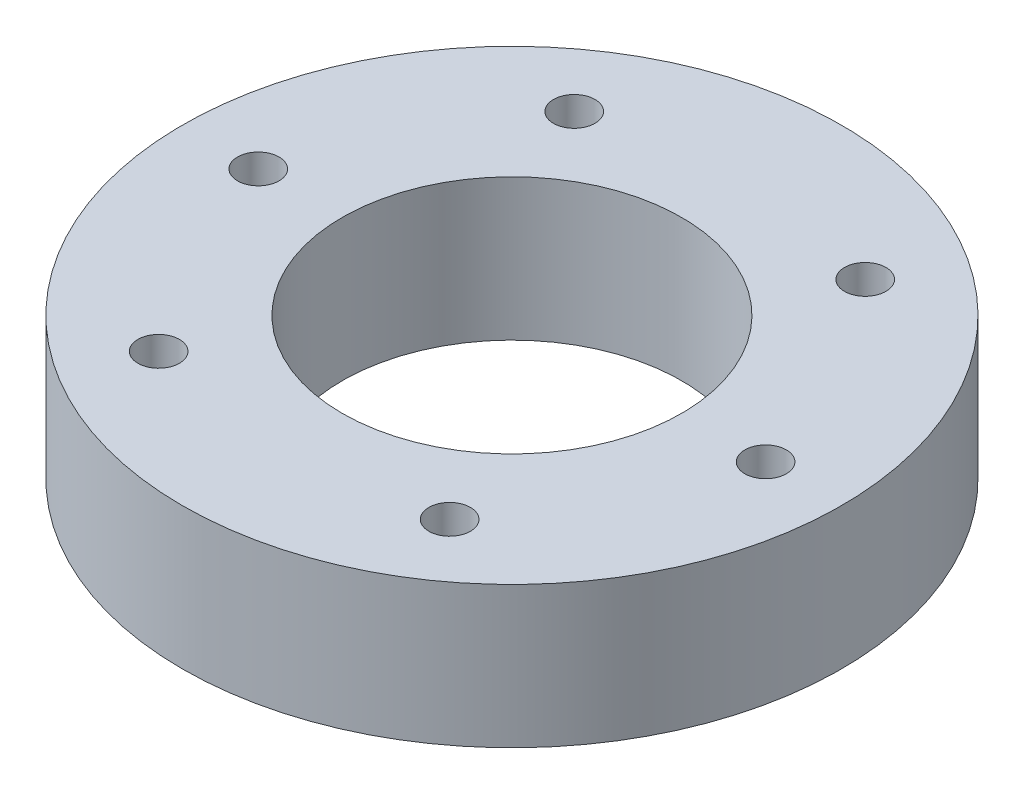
ISO-10303-21;
HEADER;
FILE_DESCRIPTION(('STEP AP214'),'2;1');
FILE_NAME('part.step','',(''),(''),'','','');
FILE_SCHEMA(('AUTOMOTIVE_DESIGN { 1 0 10303 214 1 1 1 1 }'));
ENDSEC;
DATA;
#1=APPLICATION_CONTEXT('core data for automotive mechanical design processes');
#2=APPLICATION_PROTOCOL_DEFINITION('international standard','automotive_design',2000,#1);
#3=PRODUCT_CONTEXT('',#1,'mechanical');
#4=PRODUCT('Part','Part','',(#3));
#5=PRODUCT_RELATED_PRODUCT_CATEGORY('part','',(#4));
#6=PRODUCT_DEFINITION_FORMATION('','',#4);
#7=PRODUCT_DEFINITION_CONTEXT('part definition',#1,'design');
#8=PRODUCT_DEFINITION('design','',#6,#7);
#9=PRODUCT_DEFINITION_SHAPE('','',#8);
#10=(LENGTH_UNIT() NAMED_UNIT(*) SI_UNIT(.MILLI.,.METRE.));
#11=(NAMED_UNIT(*) PLANE_ANGLE_UNIT() SI_UNIT($,.RADIAN.));
#12=(NAMED_UNIT(*) SI_UNIT($,.STERADIAN.) SOLID_ANGLE_UNIT());
#13=UNCERTAINTY_MEASURE_WITH_UNIT(LENGTH_MEASURE(1.E-05),#10,'distance_accuracy_value','');
#14=(GEOMETRIC_REPRESENTATION_CONTEXT(3) GLOBAL_UNCERTAINTY_ASSIGNED_CONTEXT((#13)) GLOBAL_UNIT_ASSIGNED_CONTEXT((#10,
#11,#12)) REPRESENTATION_CONTEXT('',''));
#15=CARTESIAN_POINT('',(0.,0.,0.));
#16=DIRECTION('',(0.,0.,1.));
#17=DIRECTION('',(1.,0.,0.));
#18=AXIS2_PLACEMENT_3D('',#15,#16,#17);
#19=CARTESIAN_POINT('',(0.,7.5,0.));
#20=DIRECTION('',(0.,1.,0.));
#21=DIRECTION('',(0.,0.,1.));
#22=AXIS2_PLACEMENT_3D('',#19,#20,#21);
#23=PLANE('',#22);
#24=CARTESIAN_POINT('',(15.4292061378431,7.5,22.0351899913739));
#25=DIRECTION('',(0.,1.,0.));
#26=DIRECTION('',(0.,0.,1.));
#27=AXIS2_PLACEMENT_3D('',#24,#25,#26);
#28=CIRCLE('',#27,2.2);
#29=CARTESIAN_POINT('',(15.4292061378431,7.5,24.2351899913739));
#30=VERTEX_POINT('',#29);
#31=EDGE_CURVE('E59',#30,#30,#28,.T.);
#32=ORIENTED_EDGE('',*,*,#31,.F.);
#33=EDGE_LOOP('',(#32));
#34=FACE_BOUND('',#33,.T.);
#35=CARTESIAN_POINT('',(26.9,7.5,0.));
#36=DIRECTION('',(0.,1.,0.));
#37=DIRECTION('',(0.,0.,1.));
#38=AXIS2_PLACEMENT_3D('',#35,#36,#37);
#39=CIRCLE('',#38,2.2);
#40=CARTESIAN_POINT('',(26.9,7.5,2.2));
#41=VERTEX_POINT('',#40);
#42=EDGE_CURVE('E65',#41,#41,#39,.T.);
#43=ORIENTED_EDGE('',*,*,#42,.F.);
#44=EDGE_LOOP('',(#43));
#45=FACE_BOUND('',#44,.T.);
#46=CARTESIAN_POINT('',(15.4292061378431,7.5,-22.0351899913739));
#47=DIRECTION('',(0.,1.,0.));
#48=DIRECTION('',(0.,0.,1.));
#49=AXIS2_PLACEMENT_3D('',#46,#47,#48);
#50=CIRCLE('',#49,2.2);
#51=CARTESIAN_POINT('',(15.4292061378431,7.5,-19.8351899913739));
#52=VERTEX_POINT('',#51);
#53=EDGE_CURVE('E71',#52,#52,#50,.T.);
#54=ORIENTED_EDGE('',*,*,#53,.F.);
#55=EDGE_LOOP('',(#54));
#56=FACE_BOUND('',#55,.T.);
#57=CARTESIAN_POINT('',(-15.4292061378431,7.5,-22.0351899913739));
#58=DIRECTION('',(0.,1.,0.));
#59=DIRECTION('',(0.,0.,1.));
#60=AXIS2_PLACEMENT_3D('',#57,#58,#59);
#61=CIRCLE('',#60,2.2);
#62=CARTESIAN_POINT('',(-15.4292061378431,7.5,-19.8351899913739));
#63=VERTEX_POINT('',#62);
#64=EDGE_CURVE('E77',#63,#63,#61,.T.);
#65=ORIENTED_EDGE('',*,*,#64,.F.);
#66=EDGE_LOOP('',(#65));
#67=FACE_BOUND('',#66,.T.);
#68=CARTESIAN_POINT('',(-26.9,7.5,0.));
#69=DIRECTION('',(0.,1.,0.));
#70=DIRECTION('',(0.,0.,1.));
#71=AXIS2_PLACEMENT_3D('',#68,#69,#70);
#72=CIRCLE('',#71,2.2);
#73=CARTESIAN_POINT('',(-26.9,7.5,2.2));
#74=VERTEX_POINT('',#73);
#75=EDGE_CURVE('E83',#74,#74,#72,.T.);
#76=ORIENTED_EDGE('',*,*,#75,.F.);
#77=EDGE_LOOP('',(#76));
#78=FACE_BOUND('',#77,.T.);
#79=CARTESIAN_POINT('',(-15.4292061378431,7.5,22.0351899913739));
#80=DIRECTION('',(0.,1.,0.));
#81=DIRECTION('',(0.,0.,1.));
#82=AXIS2_PLACEMENT_3D('',#79,#80,#81);
#83=CIRCLE('',#82,2.2);
#84=CARTESIAN_POINT('',(-15.4292061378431,7.5,24.2351899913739));
#85=VERTEX_POINT('',#84);
#86=EDGE_CURVE('E53',#85,#85,#83,.T.);
#87=ORIENTED_EDGE('',*,*,#86,.F.);
#88=EDGE_LOOP('',(#87));
#89=FACE_BOUND('',#88,.T.);
#90=CARTESIAN_POINT('',(0.,7.5,0.));
#91=DIRECTION('',(0.,1.,0.));
#92=DIRECTION('',(0.,0.,1.));
#93=AXIS2_PLACEMENT_3D('',#90,#91,#92);
#94=CIRCLE('',#93,34.95);
#95=CARTESIAN_POINT('',(0.,7.5,34.95));
#96=VERTEX_POINT('',#95);
#97=EDGE_CURVE('E10',#96,#96,#94,.T.);
#98=ORIENTED_EDGE('',*,*,#97,.T.);
#99=EDGE_LOOP('',(#98));
#100=FACE_BOUND('',#99,.T.);
#101=CARTESIAN_POINT('',(0.,7.5,0.));
#102=DIRECTION('',(0.,1.,0.));
#103=DIRECTION('',(0.,0.,1.));
#104=AXIS2_PLACEMENT_3D('',#101,#102,#103);
#105=CIRCLE('',#104,18.);
#106=CARTESIAN_POINT('',(0.,7.5,18.));
#107=VERTEX_POINT('',#106);
#108=EDGE_CURVE('E45',#107,#107,#105,.T.);
#109=ORIENTED_EDGE('',*,*,#108,.F.);
#110=EDGE_LOOP('',(#109));
#111=FACE_BOUND('',#110,.T.);
#112=ADVANCED_FACE('F34',(#34,#45,#56,#67,#78,#89,#100,#111),#23,.T.);
#113=CARTESIAN_POINT('',(0.,-7.5,0.));
#114=DIRECTION('',(0.,1.,0.));
#115=DIRECTION('',(0.,0.,1.));
#116=AXIS2_PLACEMENT_3D('',#113,#114,#115);
#117=PLANE('',#116);
#118=CARTESIAN_POINT('',(0.,-7.5,0.));
#119=DIRECTION('',(0.,1.,0.));
#120=DIRECTION('',(0.,0.,1.));
#121=AXIS2_PLACEMENT_3D('',#118,#119,#120);
#122=CIRCLE('',#121,34.95);
#123=CARTESIAN_POINT('',(0.,-7.5,34.95));
#124=VERTEX_POINT('',#123);
#125=EDGE_CURVE('E38',#124,#124,#122,.T.);
#126=ORIENTED_EDGE('',*,*,#125,.F.);
#127=EDGE_LOOP('',(#126));
#128=FACE_BOUND('',#127,.T.);
#129=CARTESIAN_POINT('',(0.,-7.5,0.));
#130=DIRECTION('',(0.,1.,0.));
#131=DIRECTION('',(0.,0.,1.));
#132=AXIS2_PLACEMENT_3D('',#129,#130,#131);
#133=CIRCLE('',#132,18.);
#134=CARTESIAN_POINT('',(0.,-7.5,18.));
#135=VERTEX_POINT('',#134);
#136=EDGE_CURVE('E47',#135,#135,#133,.T.);
#137=ORIENTED_EDGE('',*,*,#136,.T.);
#138=EDGE_LOOP('',(#137));
#139=FACE_BOUND('',#138,.T.);
#140=ADVANCED_FACE('F100',(#128,#139),#117,.F.);
#141=CARTESIAN_POINT('',(0.,7.5,0.));
#142=DIRECTION('',(0.,-1.,0.));
#143=DIRECTION('',(0.,0.,-1.));
#144=AXIS2_PLACEMENT_3D('',#141,#142,#143);
#145=CYLINDRICAL_SURFACE('',#144,34.95);
#146=ORIENTED_EDGE('',*,*,#97,.F.);
#147=EDGE_LOOP('',(#146));
#148=FACE_BOUND('',#147,.T.);
#149=ORIENTED_EDGE('',*,*,#125,.T.);
#150=EDGE_LOOP('',(#149));
#151=FACE_BOUND('',#150,.T.);
#152=ADVANCED_FACE('F36',(#148,#151),#145,.T.);
#153=CARTESIAN_POINT('',(0.,7.5,0.));
#154=DIRECTION('',(0.,-1.,0.));
#155=DIRECTION('',(0.,0.,-1.));
#156=AXIS2_PLACEMENT_3D('',#153,#154,#155);
#157=CYLINDRICAL_SURFACE('',#156,18.);
#158=ORIENTED_EDGE('',*,*,#108,.T.);
#159=EDGE_LOOP('',(#158));
#160=FACE_BOUND('',#159,.T.);
#161=ORIENTED_EDGE('',*,*,#136,.F.);
#162=EDGE_LOOP('',(#161));
#163=FACE_BOUND('',#162,.T.);
#164=ADVANCED_FACE('F107',(#160,#163),#157,.F.);
#165=CARTESIAN_POINT('',(-15.4292061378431,-2.5,22.0351899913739));
#166=DIRECTION('',(0.,1.,0.));
#167=DIRECTION('',(0.,0.,1.));
#168=AXIS2_PLACEMENT_3D('',#165,#166,#167);
#169=CYLINDRICAL_SURFACE('',#168,2.2);
#170=CARTESIAN_POINT('',(-15.4292061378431,-2.5,22.0351899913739));
#171=DIRECTION('',(0.,1.,0.));
#172=DIRECTION('',(0.,0.,1.));
#173=AXIS2_PLACEMENT_3D('',#170,#171,#172);
#174=CIRCLE('',#173,2.2);
#175=CARTESIAN_POINT('',(-15.4292061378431,-2.5,24.2351899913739));
#176=VERTEX_POINT('',#175);
#177=EDGE_CURVE('E50',#176,#176,#174,.T.);
#178=ORIENTED_EDGE('',*,*,#177,.F.);
#179=EDGE_LOOP('',(#178));
#180=FACE_BOUND('',#179,.T.);
#181=ORIENTED_EDGE('',*,*,#86,.T.);
#182=EDGE_LOOP('',(#181));
#183=FACE_BOUND('',#182,.T.);
#184=ADVANCED_FACE('F110',(#180,#183),#169,.F.);
#185=CARTESIAN_POINT('',(-15.4292061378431,-2.5,22.0351899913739));
#186=DIRECTION('',(0.,1.,0.));
#187=DIRECTION('',(0.,0.,1.));
#188=AXIS2_PLACEMENT_3D('',#185,#186,#187);
#189=PLANE('',#188);
#190=ORIENTED_EDGE('',*,*,#177,.T.);
#191=EDGE_LOOP('',(#190));
#192=FACE_BOUND('',#191,.T.);
#193=ADVANCED_FACE('F94',(#192),#189,.T.);
#194=CARTESIAN_POINT('',(-26.9,-2.5,0.));
#195=DIRECTION('',(0.,1.,0.));
#196=DIRECTION('',(0.,0.,1.));
#197=AXIS2_PLACEMENT_3D('',#194,#195,#196);
#198=CYLINDRICAL_SURFACE('',#197,2.2);
#199=CARTESIAN_POINT('',(-26.9,-2.5,0.));
#200=DIRECTION('',(0.,1.,0.));
#201=DIRECTION('',(0.,0.,1.));
#202=AXIS2_PLACEMENT_3D('',#199,#200,#201);
#203=CIRCLE('',#202,2.2);
#204=CARTESIAN_POINT('',(-26.9,-2.5,2.2));
#205=VERTEX_POINT('',#204);
#206=EDGE_CURVE('E56',#205,#205,#203,.T.);
#207=ORIENTED_EDGE('',*,*,#206,.F.);
#208=EDGE_LOOP('',(#207));
#209=FACE_BOUND('',#208,.T.);
#210=ORIENTED_EDGE('',*,*,#75,.T.);
#211=EDGE_LOOP('',(#210));
#212=FACE_BOUND('',#211,.T.);
#213=ADVANCED_FACE('F91',(#209,#212),#198,.F.);
#214=CARTESIAN_POINT('',(-26.9,-2.5,0.));
#215=DIRECTION('',(0.,1.,0.));
#216=DIRECTION('',(0.,0.,1.));
#217=AXIS2_PLACEMENT_3D('',#214,#215,#216);
#218=PLANE('',#217);
#219=ORIENTED_EDGE('',*,*,#206,.T.);
#220=EDGE_LOOP('',(#219));
#221=FACE_BOUND('',#220,.T.);
#222=ADVANCED_FACE('F89',(#221),#218,.T.);
#223=CARTESIAN_POINT('',(-15.4292061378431,-2.5,-22.0351899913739));
#224=DIRECTION('',(0.,1.,0.));
#225=DIRECTION('',(0.,0.,1.));
#226=AXIS2_PLACEMENT_3D('',#223,#224,#225);
#227=CYLINDRICAL_SURFACE('',#226,2.2);
#228=CARTESIAN_POINT('',(-15.4292061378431,-2.5,-22.0351899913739));
#229=DIRECTION('',(0.,1.,0.));
#230=DIRECTION('',(0.,0.,1.));
#231=AXIS2_PLACEMENT_3D('',#228,#229,#230);
#232=CIRCLE('',#231,2.2);
#233=CARTESIAN_POINT('',(-15.4292061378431,-2.5,-19.8351899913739));
#234=VERTEX_POINT('',#233);
#235=EDGE_CURVE('E80',#234,#234,#232,.T.);
#236=ORIENTED_EDGE('',*,*,#235,.F.);
#237=EDGE_LOOP('',(#236));
#238=FACE_BOUND('',#237,.T.);
#239=ORIENTED_EDGE('',*,*,#64,.T.);
#240=EDGE_LOOP('',(#239));
#241=FACE_BOUND('',#240,.T.);
#242=ADVANCED_FACE('F153',(#238,#241),#227,.F.);
#243=CARTESIAN_POINT('',(-15.4292061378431,-2.5,-22.0351899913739));
#244=DIRECTION('',(0.,1.,0.));
#245=DIRECTION('',(0.,0.,1.));
#246=AXIS2_PLACEMENT_3D('',#243,#244,#245);
#247=PLANE('',#246);
#248=ORIENTED_EDGE('',*,*,#235,.T.);
#249=EDGE_LOOP('',(#248));
#250=FACE_BOUND('',#249,.T.);
#251=ADVANCED_FACE('F148',(#250),#247,.T.);
#252=CARTESIAN_POINT('',(15.4292061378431,-2.5,-22.0351899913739));
#253=DIRECTION('',(0.,1.,0.));
#254=DIRECTION('',(0.,0.,1.));
#255=AXIS2_PLACEMENT_3D('',#252,#253,#254);
#256=CYLINDRICAL_SURFACE('',#255,2.2);
#257=CARTESIAN_POINT('',(15.4292061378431,-2.5,-22.0351899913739));
#258=DIRECTION('',(0.,1.,0.));
#259=DIRECTION('',(0.,0.,1.));
#260=AXIS2_PLACEMENT_3D('',#257,#258,#259);
#261=CIRCLE('',#260,2.2);
#262=CARTESIAN_POINT('',(15.4292061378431,-2.5,-19.8351899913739));
#263=VERTEX_POINT('',#262);
#264=EDGE_CURVE('E74',#263,#263,#261,.T.);
#265=ORIENTED_EDGE('',*,*,#264,.F.);
#266=EDGE_LOOP('',(#265));
#267=FACE_BOUND('',#266,.T.);
#268=ORIENTED_EDGE('',*,*,#53,.T.);
#269=EDGE_LOOP('',(#268));
#270=FACE_BOUND('',#269,.T.);
#271=ADVANCED_FACE('F145',(#267,#270),#256,.F.);
#272=CARTESIAN_POINT('',(15.4292061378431,-2.5,-22.0351899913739));
#273=DIRECTION('',(0.,1.,0.));
#274=DIRECTION('',(0.,0.,1.));
#275=AXIS2_PLACEMENT_3D('',#272,#273,#274);
#276=PLANE('',#275);
#277=ORIENTED_EDGE('',*,*,#264,.T.);
#278=EDGE_LOOP('',(#277));
#279=FACE_BOUND('',#278,.T.);
#280=ADVANCED_FACE('F140',(#279),#276,.T.);
#281=CARTESIAN_POINT('',(26.9,-2.5,0.));
#282=DIRECTION('',(0.,1.,0.));
#283=DIRECTION('',(0.,0.,1.));
#284=AXIS2_PLACEMENT_3D('',#281,#282,#283);
#285=CYLINDRICAL_SURFACE('',#284,2.2);
#286=CARTESIAN_POINT('',(26.9,-2.5,0.));
#287=DIRECTION('',(0.,1.,0.));
#288=DIRECTION('',(0.,0.,1.));
#289=AXIS2_PLACEMENT_3D('',#286,#287,#288);
#290=CIRCLE('',#289,2.2);
#291=CARTESIAN_POINT('',(26.9,-2.5,2.2));
#292=VERTEX_POINT('',#291);
#293=EDGE_CURVE('E68',#292,#292,#290,.T.);
#294=ORIENTED_EDGE('',*,*,#293,.F.);
#295=EDGE_LOOP('',(#294));
#296=FACE_BOUND('',#295,.T.);
#297=ORIENTED_EDGE('',*,*,#42,.T.);
#298=EDGE_LOOP('',(#297));
#299=FACE_BOUND('',#298,.T.);
#300=ADVANCED_FACE('F137',(#296,#299),#285,.F.);
#301=CARTESIAN_POINT('',(26.9,-2.5,0.));
#302=DIRECTION('',(0.,1.,0.));
#303=DIRECTION('',(0.,0.,1.));
#304=AXIS2_PLACEMENT_3D('',#301,#302,#303);
#305=PLANE('',#304);
#306=ORIENTED_EDGE('',*,*,#293,.T.);
#307=EDGE_LOOP('',(#306));
#308=FACE_BOUND('',#307,.T.);
#309=ADVANCED_FACE('F132',(#308),#305,.T.);
#310=CARTESIAN_POINT('',(15.4292061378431,-2.5,22.0351899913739));
#311=DIRECTION('',(0.,1.,0.));
#312=DIRECTION('',(0.,0.,1.));
#313=AXIS2_PLACEMENT_3D('',#310,#311,#312);
#314=CYLINDRICAL_SURFACE('',#313,2.2);
#315=CARTESIAN_POINT('',(15.4292061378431,-2.5,22.0351899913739));
#316=DIRECTION('',(0.,1.,0.));
#317=DIRECTION('',(0.,0.,1.));
#318=AXIS2_PLACEMENT_3D('',#315,#316,#317);
#319=CIRCLE('',#318,2.2);
#320=CARTESIAN_POINT('',(15.4292061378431,-2.5,24.2351899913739));
#321=VERTEX_POINT('',#320);
#322=EDGE_CURVE('E62',#321,#321,#319,.T.);
#323=ORIENTED_EDGE('',*,*,#322,.F.);
#324=EDGE_LOOP('',(#323));
#325=FACE_BOUND('',#324,.T.);
#326=ORIENTED_EDGE('',*,*,#31,.T.);
#327=EDGE_LOOP('',(#326));
#328=FACE_BOUND('',#327,.T.);
#329=ADVANCED_FACE('F128',(#325,#328),#314,.F.);
#330=CARTESIAN_POINT('',(15.4292061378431,-2.5,22.0351899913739));
#331=DIRECTION('',(0.,1.,0.));
#332=DIRECTION('',(0.,0.,1.));
#333=AXIS2_PLACEMENT_3D('',#330,#331,#332);
#334=PLANE('',#333);
#335=ORIENTED_EDGE('',*,*,#322,.T.);
#336=EDGE_LOOP('',(#335));
#337=FACE_BOUND('',#336,.T.);
#338=ADVANCED_FACE('F131',(#337),#334,.T.);
#339=CLOSED_SHELL('',(#112,#140,#152,#164,#184,#193,#213,#222,#242,#251,#271,#280,#300,#309,
#329,#338));
#340=MANIFOLD_SOLID_BREP('B2',#339);
#341=ADVANCED_BREP_SHAPE_REPRESENTATION('',(#18,#340),#14);
#342=SHAPE_DEFINITION_REPRESENTATION(#9,#341);
ENDSEC;
END-ISO-10303-21;
